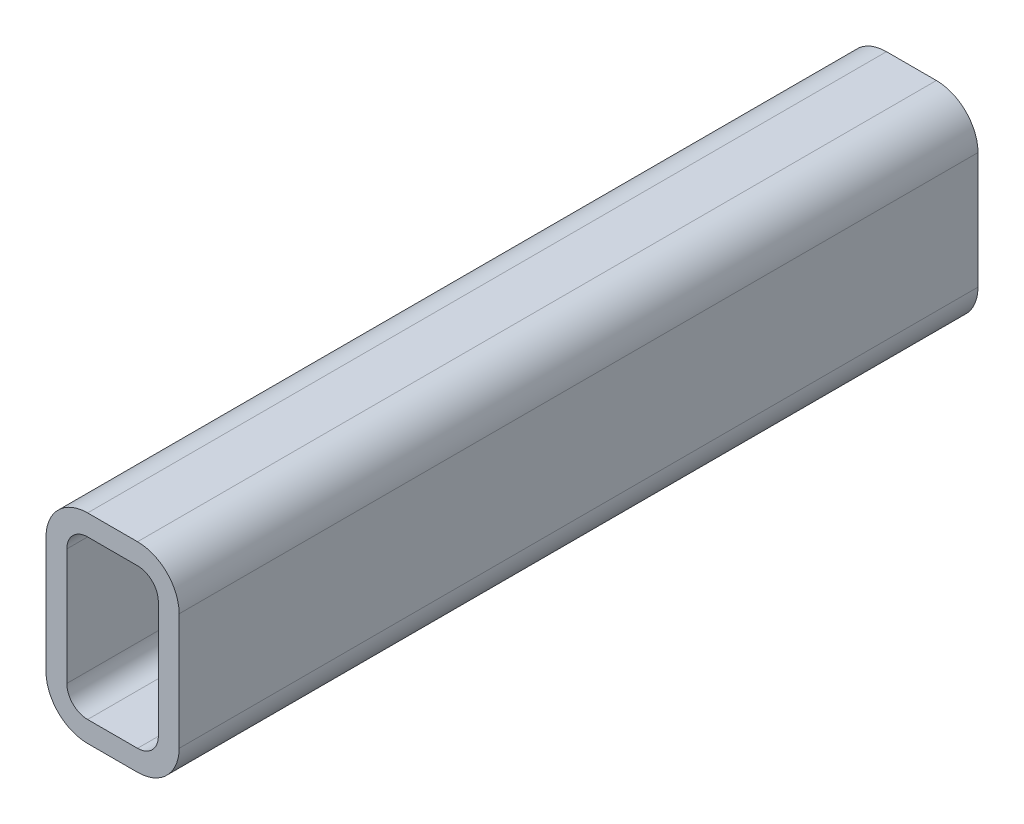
from build123d import *

# Parameters (mm, degrees)
BOSS_EXTRUDE1_DEPTH = 304.8


with BuildPart() as part:
    # Sketch1 → Boss-Extrude1 (new body)
    with BuildSketch(Plane.XY):
        with BuildLine():
            Line((15.875, 76.2), (34.925, 76.2))
            ThreePointArc((34.925, 76.2), (46.150320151, 71.550320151), (50.8, 60.325))
            Line((50.8, 60.325), (50.8, 15.875))
            ThreePointArc((50.8, 15.875), (46.150320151, 4.649679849), (34.925, 0))
            Line((34.925, 0), (15.875, 0))
            ThreePointArc((15.875, 0), (4.649679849, 4.649679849), (0, 15.875))
            Line((0, 15.875), (0, 60.325))
            ThreePointArc((0, 60.325), (4.649679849, 71.550320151), (15.875, 76.2))
        make_face()
        with BuildLine():
            Line((15.875, 68.2625), (34.925, 68.2625))
            ThreePointArc((34.925, 68.2625), (40.537660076, 65.937660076), (42.8625, 60.325))
            Line((42.8625, 60.325), (42.8625, 15.875))
            ThreePointArc((42.8625, 15.875), (40.537660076, 10.262339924), (34.925, 7.9375))
            Line((34.925, 7.9375), (15.875, 7.9375))
            ThreePointArc((15.875, 7.9375), (10.262339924, 10.262339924), (7.9375, 15.875))
            Line((7.9375, 15.875), (7.9375, 60.325))
            ThreePointArc((7.9375, 60.325), (10.262339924, 65.937660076), (15.875, 68.2625))
        make_face(mode=Mode.SUBTRACT)
    extrude(amount=BOSS_EXTRUDE1_DEPTH)


solid = part.part
